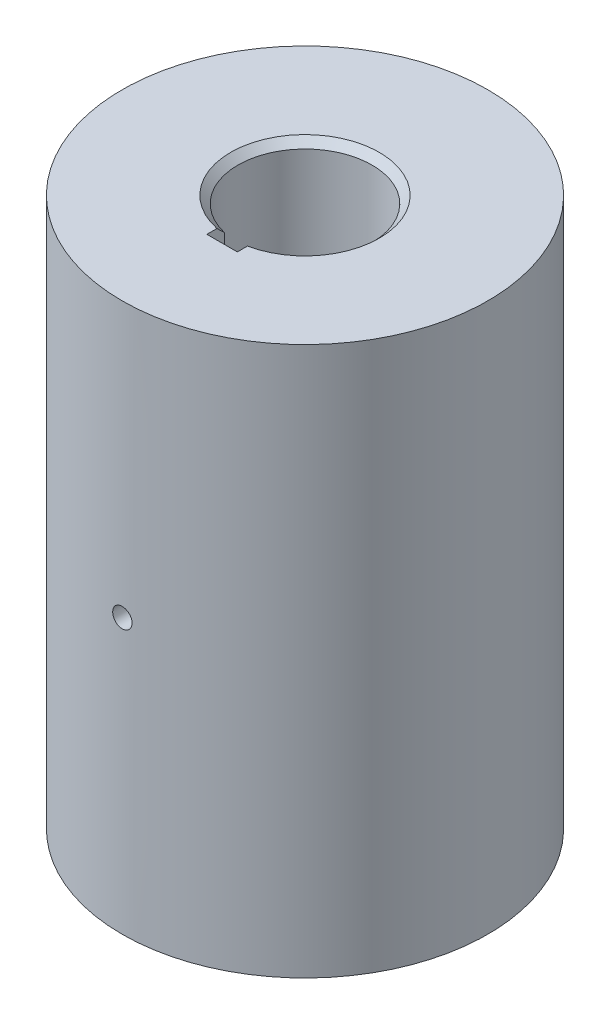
ISO-10303-21;
HEADER;
FILE_DESCRIPTION(('STEP AP214'),'2;1');
FILE_NAME('part.step','',(''),(''),'','','');
FILE_SCHEMA(('AUTOMOTIVE_DESIGN { 1 0 10303 214 1 1 1 1 }'));
ENDSEC;
DATA;
#1=APPLICATION_CONTEXT('core data for automotive mechanical design processes');
#2=APPLICATION_PROTOCOL_DEFINITION('international standard','automotive_design',2000,#1);
#3=PRODUCT_CONTEXT('',#1,'mechanical');
#4=PRODUCT('Part','Part','',(#3));
#5=PRODUCT_RELATED_PRODUCT_CATEGORY('part','',(#4));
#6=PRODUCT_DEFINITION_FORMATION('','',#4);
#7=PRODUCT_DEFINITION_CONTEXT('part definition',#1,'design');
#8=PRODUCT_DEFINITION('design','',#6,#7);
#9=PRODUCT_DEFINITION_SHAPE('','',#8);
#10=(LENGTH_UNIT() NAMED_UNIT(*) SI_UNIT(.MILLI.,.METRE.));
#11=(NAMED_UNIT(*) PLANE_ANGLE_UNIT() SI_UNIT($,.RADIAN.));
#12=(NAMED_UNIT(*) SI_UNIT($,.STERADIAN.) SOLID_ANGLE_UNIT());
#13=UNCERTAINTY_MEASURE_WITH_UNIT(LENGTH_MEASURE(1.E-05),#10,'distance_accuracy_value','');
#14=(GEOMETRIC_REPRESENTATION_CONTEXT(3) GLOBAL_UNCERTAINTY_ASSIGNED_CONTEXT((#13)) GLOBAL_UNIT_ASSIGNED_CONTEXT((#10,
#11,#12)) REPRESENTATION_CONTEXT('',''));
#15=CARTESIAN_POINT('',(0.,0.,0.));
#16=DIRECTION('',(0.,0.,1.));
#17=DIRECTION('',(1.,0.,0.));
#18=AXIS2_PLACEMENT_3D('',#15,#16,#17);
#19=CARTESIAN_POINT('',(0.,114.3,0.));
#20=DIRECTION('',(0.,-1.,0.));
#21=DIRECTION('',(0.,0.,-1.));
#22=AXIS2_PLACEMENT_3D('',#19,#20,#21);
#23=CYLINDRICAL_SURFACE('',#22,38.1);
#24=CARTESIAN_POINT('',(2.0193,57.15,38.0464509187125));
#25=CARTESIAN_POINT('',(2.01929500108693,57.0366605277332,38.046451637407));
#26=CARTESIAN_POINT('',(2.00972565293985,56.9232409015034,38.0469628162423));
#27=CARTESIAN_POINT('',(1.97168770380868,56.6995311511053,38.048952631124));
#28=CARTESIAN_POINT('',(1.94319689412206,56.5892448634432,38.0504324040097));
#29=CARTESIAN_POINT('',(1.86813462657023,56.3750747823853,38.0541913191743));
#30=CARTESIAN_POINT('',(1.82157245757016,56.2711877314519,38.0564700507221));
#31=CARTESIAN_POINT('',(1.71170363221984,56.0727319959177,38.0615695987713));
#32=CARTESIAN_POINT('',(1.64840090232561,55.9781611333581,38.0643902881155));
#33=CARTESIAN_POINT('',(1.50676927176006,55.8008884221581,38.0702595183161));
#34=CARTESIAN_POINT('',(1.4284256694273,55.718198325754,38.0733082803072));
#35=CARTESIAN_POINT('',(1.258965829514,55.5671347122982,38.0792880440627));
#36=CARTESIAN_POINT('',(1.16784906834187,55.498761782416,38.0822190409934));
#37=CARTESIAN_POINT('',(0.97536669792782,55.3782400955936,38.087634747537));
#38=CARTESIAN_POINT('',(0.873995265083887,55.3261006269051,38.0901192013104));
#39=CARTESIAN_POINT('',(0.663922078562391,55.2395854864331,38.094359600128));
#40=CARTESIAN_POINT('',(0.555220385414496,55.2052096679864,38.0961155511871));
#41=CARTESIAN_POINT('',(0.333681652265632,55.1552290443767,38.0986995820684));
#42=CARTESIAN_POINT('',(0.220848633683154,55.1396064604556,38.0995285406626));
#43=CARTESIAN_POINT('',(-0.00584114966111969,55.1275208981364,38.1001681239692));
#44=CARTESIAN_POINT('',(-0.119697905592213,55.131057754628,38.0999787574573));
#45=CARTESIAN_POINT('',(-0.345082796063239,55.1571759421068,38.0986037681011));
#46=CARTESIAN_POINT('',(-0.456613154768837,55.179738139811,38.0974191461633));
#47=CARTESIAN_POINT('',(-0.674301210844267,55.2432368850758,38.0941882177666));
#48=CARTESIAN_POINT('',(-0.78045888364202,55.2841735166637,38.0921419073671));
#49=CARTESIAN_POINT('',(-0.984449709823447,55.3832808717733,38.0874163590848));
#50=CARTESIAN_POINT('',(-1.08227862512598,55.4414603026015,38.0847368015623));
#51=CARTESIAN_POINT('',(-1.2667886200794,55.5733954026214,38.0790464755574));
#52=CARTESIAN_POINT('',(-1.35346961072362,55.6471511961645,38.0760357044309));
#53=CARTESIAN_POINT('',(-1.51333480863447,55.8082535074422,38.0700175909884));
#54=CARTESIAN_POINT('',(-1.58650228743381,55.8956166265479,38.067010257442));
#55=CARTESIAN_POINT('',(-1.71713461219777,56.0813953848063,38.0613417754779));
#56=CARTESIAN_POINT('',(-1.7745994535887,56.1798110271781,38.058680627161));
#57=CARTESIAN_POINT('',(-1.87219388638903,56.3849113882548,38.0540049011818));
#58=CARTESIAN_POINT('',(-1.91232283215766,56.4915964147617,38.0519903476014));
#59=CARTESIAN_POINT('',(-1.9740951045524,56.7102025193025,38.0488359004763));
#60=CARTESIAN_POINT('',(-1.99573858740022,56.8221235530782,38.0476959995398));
#61=CARTESIAN_POINT('',(-2.01990483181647,57.0478788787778,38.0464207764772));
#62=CARTESIAN_POINT('',(-2.02245081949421,57.1617106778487,38.0462842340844));
#63=CARTESIAN_POINT('',(-2.00841042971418,57.388184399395,38.0470279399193));
#64=CARTESIAN_POINT('',(-1.99182412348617,57.5008263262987,38.0479081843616));
#65=CARTESIAN_POINT('',(-1.94000924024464,57.7216574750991,38.0505851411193));
#66=CARTESIAN_POINT('',(-1.90479130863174,57.8298492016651,38.0523813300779));
#67=CARTESIAN_POINT('',(-1.81672365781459,58.0387859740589,38.0566872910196));
#68=CARTESIAN_POINT('',(-1.76387382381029,58.1395309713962,38.0591970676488));
#69=CARTESIAN_POINT('',(-1.64198302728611,58.3308213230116,38.0646503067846));
#70=CARTESIAN_POINT('',(-1.57292647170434,58.4213567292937,38.0675941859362));
#71=CARTESIAN_POINT('',(-1.4206052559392,58.5895578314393,38.0735823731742));
#72=CARTESIAN_POINT('',(-1.33734049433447,58.6672234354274,38.0766266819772));
#73=CARTESIAN_POINT('',(-1.15886664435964,58.8075584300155,38.0824761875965));
#74=CARTESIAN_POINT('',(-1.06364574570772,58.8702128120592,38.0852811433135));
#75=CARTESIAN_POINT('',(-0.864022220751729,58.9786442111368,38.0903323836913));
#76=CARTESIAN_POINT('',(-0.759619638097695,59.0244213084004,38.0925786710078));
#77=CARTESIAN_POINT('',(-0.544652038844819,59.0977724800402,38.096258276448));
#78=CARTESIAN_POINT('',(-0.434090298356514,59.125356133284,38.0976920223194));
#79=CARTESIAN_POINT('',(-0.209897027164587,59.1615687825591,38.0995866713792));
#80=CARTESIAN_POINT('',(-0.0962655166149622,59.1701979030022,38.1000475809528));
#81=CARTESIAN_POINT('',(0.130692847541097,59.1682553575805,38.0999446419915));
#82=CARTESIAN_POINT('',(0.244019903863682,59.1577072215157,38.0993820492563));
#83=CARTESIAN_POINT('',(0.467291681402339,59.1177582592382,38.0972979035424));
#84=CARTESIAN_POINT('',(0.577236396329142,59.0883573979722,38.0957763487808));
#85=CARTESIAN_POINT('',(0.79062713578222,59.0115425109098,38.0919454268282));
#86=CARTESIAN_POINT('',(0.894073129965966,58.9641284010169,38.0896360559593));
#87=CARTESIAN_POINT('',(1.09153828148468,58.8526367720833,38.0844891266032));
#88=CARTESIAN_POINT('',(1.18555771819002,58.7885597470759,38.0816515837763));
#89=CARTESIAN_POINT('',(1.36161896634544,58.6454761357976,38.0757636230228));
#90=CARTESIAN_POINT('',(1.4436472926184,58.5664529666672,38.0727129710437));
#91=CARTESIAN_POINT('',(1.59329977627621,58.3957345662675,38.0667442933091));
#92=CARTESIAN_POINT('',(1.66092038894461,58.3040362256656,38.0638263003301));
#93=CARTESIAN_POINT('',(1.77987367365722,58.1104911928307,38.0584499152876));
#94=CARTESIAN_POINT('',(1.83118964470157,58.0086342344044,38.0559919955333));
#95=CARTESIAN_POINT('',(1.91593013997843,57.7978130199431,38.0518203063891));
#96=CARTESIAN_POINT('',(1.94937575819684,57.6888573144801,38.0501056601));
#97=CARTESIAN_POINT('',(1.98867080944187,57.5076890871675,38.0480670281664));
#98=CARTESIAN_POINT('',(2.00014205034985,57.4366495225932,38.0474636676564));
#99=CARTESIAN_POINT('',(2.01545822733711,57.2937507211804,38.0466553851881));
#100=CARTESIAN_POINT('',(2.01930317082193,57.221891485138,38.0464504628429));
#101=CARTESIAN_POINT('',(2.0193,57.15,38.0464509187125));
#102=B_SPLINE_CURVE_WITH_KNOTS('',3,(#24,#25,#26,#27,#28,#29,#30,#31,#32,#33,#34,#35,#36,#37,
#38,#39,#40,#41,#42,#43,#44,#45,#46,#47,#48,#49,#50,#51,#52,#53,#54,#55,#56,#57,#58,#59,#60,#61,
#62,#63,#64,#65,#66,#67,#68,#69,#70,#71,#72,#73,#74,#75,#76,#77,#78,#79,#80,#81,#82,#83,#84,#85,
#86,#87,#88,#89,#90,#91,#92,#93,#94,#95,#96,#97,#98,#99,#100,#101),.UNSPECIFIED.,.T.,.F.,(4,2,2,
2,2,2,2,2,2,2,2,2,2,2,2,2,2,2,2,2,2,2,2,2,2,2,2,2,2,2,2,2,2,2,2,2,2,2,4),(0.,0.339755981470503,
0.679911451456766,1.01989230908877,1.35979349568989,1.70002862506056,2.04027770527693,
2.38072110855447,2.72116170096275,3.06127928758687,3.40139394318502,3.74116696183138,
4.08094153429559,4.42088798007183,4.76083713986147,5.10120434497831,5.44157164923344,
5.78195162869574,6.12232873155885,6.46229180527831,6.8022536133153,7.14202138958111,
7.48179137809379,7.82188962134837,8.16199029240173,8.50242959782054,8.84286728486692,
9.18312558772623,9.52338165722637,9.86322052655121,10.2030600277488,10.5429011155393,
10.8827321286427,11.2229424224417,11.5632363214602,11.9038776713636,12.2441160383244,
12.4596242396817,12.6751322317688),.UNSPECIFIED.);
#103=CARTESIAN_POINT('',(2.0193,57.15,38.0464509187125));
#104=VERTEX_POINT('',#103);
#105=EDGE_CURVE('E11',#104,#104,#102,.T.);
#106=ORIENTED_EDGE('',*,*,#105,.T.);
#107=EDGE_LOOP('',(#106));
#108=FACE_BOUND('',#107,.T.);
#109=CARTESIAN_POINT('',(0.,114.3,0.));
#110=DIRECTION('',(0.,1.,0.));
#111=DIRECTION('',(0.,0.,1.));
#112=AXIS2_PLACEMENT_3D('',#109,#110,#111);
#113=CIRCLE('',#112,38.1);
#114=CARTESIAN_POINT('',(0.,114.3,38.1));
#115=VERTEX_POINT('',#114);
#116=EDGE_CURVE('E162',#115,#115,#113,.T.);
#117=ORIENTED_EDGE('',*,*,#116,.F.);
#118=EDGE_LOOP('',(#117));
#119=FACE_BOUND('',#118,.T.);
#120=CARTESIAN_POINT('',(0.,0.,0.));
#121=DIRECTION('',(0.,1.,0.));
#122=DIRECTION('',(0.,0.,1.));
#123=AXIS2_PLACEMENT_3D('',#120,#121,#122);
#124=CIRCLE('',#123,38.1);
#125=CARTESIAN_POINT('',(0.,0.,38.1));
#126=VERTEX_POINT('',#125);
#127=EDGE_CURVE('E161',#126,#126,#124,.T.);
#128=ORIENTED_EDGE('',*,*,#127,.T.);
#129=EDGE_LOOP('',(#128));
#130=FACE_BOUND('',#129,.T.);
#131=ADVANCED_FACE('F36',(#108,#119,#130),#23,.T.);
#132=CARTESIAN_POINT('',(0.,114.3,0.));
#133=DIRECTION('',(0.,1.,0.));
#134=DIRECTION('',(0.,0.,1.));
#135=AXIS2_PLACEMENT_3D('',#132,#133,#134);
#136=PLANE('',#135);
#137=DIRECTION('',(0.,0.,1.));
#138=VECTOR('',#137,1.);
#139=CARTESIAN_POINT('',(-3.175,114.3,0.));
#140=LINE('',#139,#138);
#141=CARTESIAN_POINT('',(-3.175,114.3,15.1652039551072));
#142=VERTEX_POINT('',#141);
#143=CARTESIAN_POINT('',(-3.175,114.3,17.272));
#144=VERTEX_POINT('',#143);
#145=EDGE_CURVE('E102',#142,#144,#140,.T.);
#146=ORIENTED_EDGE('',*,*,#145,.F.);
#147=CARTESIAN_POINT('',(0.,114.3,0.));
#148=DIRECTION('',(0.,1.,0.));
#149=DIRECTION('',(0.,0.,1.));
#150=AXIS2_PLACEMENT_3D('',#147,#148,#149);
#151=CIRCLE('',#150,15.494);
#152=CARTESIAN_POINT('',(3.175,114.3,15.1652039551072));
#153=VERTEX_POINT('',#152);
#154=EDGE_CURVE('E170',#142,#153,#151,.F.);
#155=ORIENTED_EDGE('',*,*,#154,.T.);
#156=DIRECTION('',(0.,0.,-1.));
#157=VECTOR('',#156,1.);
#158=CARTESIAN_POINT('',(3.175,114.3,0.));
#159=LINE('',#158,#157);
#160=CARTESIAN_POINT('',(3.175,114.3,17.272));
#161=VERTEX_POINT('',#160);
#162=EDGE_CURVE('E55',#161,#153,#159,.T.);
#163=ORIENTED_EDGE('',*,*,#162,.F.);
#164=DIRECTION('',(1.,0.,0.));
#165=VECTOR('',#164,1.);
#166=CARTESIAN_POINT('',(-3.175,114.3,17.272));
#167=LINE('',#166,#165);
#168=EDGE_CURVE('E122',#144,#161,#167,.T.);
#169=ORIENTED_EDGE('',*,*,#168,.F.);
#170=EDGE_LOOP('',(#146,#155,#163,#169));
#171=FACE_BOUND('',#170,.T.);
#172=ORIENTED_EDGE('',*,*,#116,.T.);
#173=EDGE_LOOP('',(#172));
#174=FACE_BOUND('',#173,.T.);
#175=ADVANCED_FACE('F228',(#171,#174),#136,.T.);
#176=CARTESIAN_POINT('',(0.,0.,0.));
#177=DIRECTION('',(0.,1.,0.));
#178=DIRECTION('',(0.,0.,1.));
#179=AXIS2_PLACEMENT_3D('',#176,#177,#178);
#180=PLANE('',#179);
#181=CARTESIAN_POINT('',(0.,0.,0.));
#182=DIRECTION('',(0.,1.,0.));
#183=DIRECTION('',(0.,0.,1.));
#184=AXIS2_PLACEMENT_3D('',#181,#182,#183);
#185=CIRCLE('',#184,13.97);
#186=CARTESIAN_POINT('',(3.175,0.,13.6044211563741));
#187=VERTEX_POINT('',#186);
#188=CARTESIAN_POINT('',(-3.175,0.,13.6044211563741));
#189=VERTEX_POINT('',#188);
#190=EDGE_CURVE('E120',#187,#189,#185,.T.);
#191=ORIENTED_EDGE('',*,*,#190,.T.);
#192=DIRECTION('',(0.,0.,1.));
#193=VECTOR('',#192,1.);
#194=CARTESIAN_POINT('',(-3.175,0.,0.));
#195=LINE('',#194,#193);
#196=CARTESIAN_POINT('',(-3.175,0.,17.272));
#197=VERTEX_POINT('',#196);
#198=EDGE_CURVE('E99',#189,#197,#195,.T.);
#199=ORIENTED_EDGE('',*,*,#198,.T.);
#200=DIRECTION('',(1.,0.,0.));
#201=VECTOR('',#200,1.);
#202=CARTESIAN_POINT('',(-3.175,0.,17.272));
#203=LINE('',#202,#201);
#204=CARTESIAN_POINT('',(3.175,0.,17.272));
#205=VERTEX_POINT('',#204);
#206=EDGE_CURVE('E110',#197,#205,#203,.T.);
#207=ORIENTED_EDGE('',*,*,#206,.T.);
#208=DIRECTION('',(0.,0.,-1.));
#209=VECTOR('',#208,1.);
#210=CARTESIAN_POINT('',(3.175,0.,0.));
#211=LINE('',#210,#209);
#212=EDGE_CURVE('E107',#205,#187,#211,.T.);
#213=ORIENTED_EDGE('',*,*,#212,.T.);
#214=EDGE_LOOP('',(#191,#199,#207,#213));
#215=FACE_BOUND('',#214,.T.);
#216=CARTESIAN_POINT('',(0.,0.,25.4));
#217=DIRECTION('',(0.,-1.,0.));
#218=DIRECTION('',(0.,0.,-1.));
#219=AXIS2_PLACEMENT_3D('',#216,#217,#218);
#220=CIRCLE('',#219,3.96875);
#221=CARTESIAN_POINT('',(0.,0.,21.43125));
#222=VERTEX_POINT('',#221);
#223=EDGE_CURVE('E137',#222,#222,#220,.T.);
#224=ORIENTED_EDGE('',*,*,#223,.F.);
#225=EDGE_LOOP('',(#224));
#226=FACE_BOUND('',#225,.T.);
#227=CARTESIAN_POINT('',(25.4,0.,0.));
#228=DIRECTION('',(0.,-1.,0.));
#229=DIRECTION('',(0.,0.,-1.));
#230=AXIS2_PLACEMENT_3D('',#227,#228,#229);
#231=CIRCLE('',#230,3.96875);
#232=CARTESIAN_POINT('',(25.4,0.,-3.96874999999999));
#233=VERTEX_POINT('',#232);
#234=EDGE_CURVE('E143',#233,#233,#231,.T.);
#235=ORIENTED_EDGE('',*,*,#234,.F.);
#236=EDGE_LOOP('',(#235));
#237=FACE_BOUND('',#236,.T.);
#238=CARTESIAN_POINT('',(0.,0.,-25.4));
#239=DIRECTION('',(0.,-1.,0.));
#240=DIRECTION('',(0.,0.,-1.));
#241=AXIS2_PLACEMENT_3D('',#238,#239,#240);
#242=CIRCLE('',#241,3.96875);
#243=CARTESIAN_POINT('',(0.,0.,-29.36875));
#244=VERTEX_POINT('',#243);
#245=EDGE_CURVE('E149',#244,#244,#242,.T.);
#246=ORIENTED_EDGE('',*,*,#245,.F.);
#247=EDGE_LOOP('',(#246));
#248=FACE_BOUND('',#247,.T.);
#249=CARTESIAN_POINT('',(-25.4,0.,0.));
#250=DIRECTION('',(0.,-1.,0.));
#251=DIRECTION('',(0.,0.,-1.));
#252=AXIS2_PLACEMENT_3D('',#249,#250,#251);
#253=CIRCLE('',#252,3.96875);
#254=CARTESIAN_POINT('',(-25.4,0.,-3.96874999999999));
#255=VERTEX_POINT('',#254);
#256=EDGE_CURVE('E155',#255,#255,#253,.T.);
#257=ORIENTED_EDGE('',*,*,#256,.F.);
#258=EDGE_LOOP('',(#257));
#259=FACE_BOUND('',#258,.T.);
#260=ORIENTED_EDGE('',*,*,#127,.F.);
#261=EDGE_LOOP('',(#260));
#262=FACE_BOUND('',#261,.T.);
#263=ADVANCED_FACE('F117',(#215,#226,#237,#248,#259,#262),#180,.F.);
#264=CARTESIAN_POINT('',(-25.4,23.8252,0.));
#265=DIRECTION('',(0.,-1.,0.));
#266=DIRECTION('',(0.,0.,-1.));
#267=AXIS2_PLACEMENT_3D('',#264,#265,#266);
#268=CONICAL_SURFACE('',#267,3.96875,1.02974425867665);
#269=CARTESIAN_POINT('',(-25.4,26.2098655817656,0.));
#270=VERTEX_POINT('',#269);
#271=VERTEX_LOOP('',#270);
#272=FACE_BOUND('',#271,.T.);
#273=CARTESIAN_POINT('',(-25.4,23.8252,0.));
#274=DIRECTION('',(0.,-1.,0.));
#275=DIRECTION('',(0.,0.,-1.));
#276=AXIS2_PLACEMENT_3D('',#273,#274,#275);
#277=CIRCLE('',#276,3.96875);
#278=CARTESIAN_POINT('',(-25.4,23.8252,-3.96874999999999));
#279=VERTEX_POINT('',#278);
#280=EDGE_CURVE('E158',#279,#279,#277,.T.);
#281=ORIENTED_EDGE('',*,*,#280,.T.);
#282=EDGE_LOOP('',(#281));
#283=FACE_BOUND('',#282,.T.);
#284=ADVANCED_FACE('F224',(#272,#283),#268,.F.);
#285=CARTESIAN_POINT('',(-25.4,0.,0.));
#286=DIRECTION('',(0.,-1.,0.));
#287=DIRECTION('',(0.,0.,-1.));
#288=AXIS2_PLACEMENT_3D('',#285,#286,#287);
#289=CYLINDRICAL_SURFACE('',#288,3.96875);
#290=ORIENTED_EDGE('',*,*,#280,.F.);
#291=EDGE_LOOP('',(#290));
#292=FACE_BOUND('',#291,.T.);
#293=ORIENTED_EDGE('',*,*,#256,.T.);
#294=EDGE_LOOP('',(#293));
#295=FACE_BOUND('',#294,.T.);
#296=ADVANCED_FACE('F220',(#292,#295),#289,.F.);
#297=CARTESIAN_POINT('',(0.,23.8252,-25.4));
#298=DIRECTION('',(0.,-1.,0.));
#299=DIRECTION('',(0.,0.,-1.));
#300=AXIS2_PLACEMENT_3D('',#297,#298,#299);
#301=CONICAL_SURFACE('',#300,3.96875,1.02974425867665);
#302=CARTESIAN_POINT('',(0.,26.2098655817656,-25.4));
#303=VERTEX_POINT('',#302);
#304=VERTEX_LOOP('',#303);
#305=FACE_BOUND('',#304,.T.);
#306=CARTESIAN_POINT('',(0.,23.8252,-25.4));
#307=DIRECTION('',(0.,-1.,0.));
#308=DIRECTION('',(0.,0.,-1.));
#309=AXIS2_PLACEMENT_3D('',#306,#307,#308);
#310=CIRCLE('',#309,3.96875);
#311=CARTESIAN_POINT('',(0.,23.8252,-29.36875));
#312=VERTEX_POINT('',#311);
#313=EDGE_CURVE('E152',#312,#312,#310,.T.);
#314=ORIENTED_EDGE('',*,*,#313,.T.);
#315=EDGE_LOOP('',(#314));
#316=FACE_BOUND('',#315,.T.);
#317=ADVANCED_FACE('F216',(#305,#316),#301,.F.);
#318=CARTESIAN_POINT('',(0.,0.,-25.4));
#319=DIRECTION('',(0.,-1.,0.));
#320=DIRECTION('',(0.,0.,-1.));
#321=AXIS2_PLACEMENT_3D('',#318,#319,#320);
#322=CYLINDRICAL_SURFACE('',#321,3.96875);
#323=ORIENTED_EDGE('',*,*,#313,.F.);
#324=EDGE_LOOP('',(#323));
#325=FACE_BOUND('',#324,.T.);
#326=ORIENTED_EDGE('',*,*,#245,.T.);
#327=EDGE_LOOP('',(#326));
#328=FACE_BOUND('',#327,.T.);
#329=ADVANCED_FACE('F212',(#325,#328),#322,.F.);
#330=CARTESIAN_POINT('',(25.4,23.8252,0.));
#331=DIRECTION('',(0.,-1.,0.));
#332=DIRECTION('',(0.,0.,-1.));
#333=AXIS2_PLACEMENT_3D('',#330,#331,#332);
#334=CONICAL_SURFACE('',#333,3.96875,1.02974425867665);
#335=CARTESIAN_POINT('',(25.4,26.2098655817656,0.));
#336=VERTEX_POINT('',#335);
#337=VERTEX_LOOP('',#336);
#338=FACE_BOUND('',#337,.T.);
#339=CARTESIAN_POINT('',(25.4,23.8252,0.));
#340=DIRECTION('',(0.,-1.,0.));
#341=DIRECTION('',(0.,0.,-1.));
#342=AXIS2_PLACEMENT_3D('',#339,#340,#341);
#343=CIRCLE('',#342,3.96875);
#344=CARTESIAN_POINT('',(25.4,23.8252,-3.96874999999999));
#345=VERTEX_POINT('',#344);
#346=EDGE_CURVE('E146',#345,#345,#343,.T.);
#347=ORIENTED_EDGE('',*,*,#346,.T.);
#348=EDGE_LOOP('',(#347));
#349=FACE_BOUND('',#348,.T.);
#350=ADVANCED_FACE('F208',(#338,#349),#334,.F.);
#351=CARTESIAN_POINT('',(25.4,0.,0.));
#352=DIRECTION('',(0.,-1.,0.));
#353=DIRECTION('',(0.,0.,-1.));
#354=AXIS2_PLACEMENT_3D('',#351,#352,#353);
#355=CYLINDRICAL_SURFACE('',#354,3.96875);
#356=ORIENTED_EDGE('',*,*,#346,.F.);
#357=EDGE_LOOP('',(#356));
#358=FACE_BOUND('',#357,.T.);
#359=ORIENTED_EDGE('',*,*,#234,.T.);
#360=EDGE_LOOP('',(#359));
#361=FACE_BOUND('',#360,.T.);
#362=ADVANCED_FACE('F204',(#358,#361),#355,.F.);
#363=CARTESIAN_POINT('',(0.,23.8252,25.4));
#364=DIRECTION('',(0.,-1.,0.));
#365=DIRECTION('',(0.,0.,-1.));
#366=AXIS2_PLACEMENT_3D('',#363,#364,#365);
#367=CONICAL_SURFACE('',#366,3.96875,1.02974425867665);
#368=CARTESIAN_POINT('',(0.,26.2098655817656,25.4));
#369=VERTEX_POINT('',#368);
#370=VERTEX_LOOP('',#369);
#371=FACE_BOUND('',#370,.T.);
#372=CARTESIAN_POINT('',(0.,23.8252,25.4));
#373=DIRECTION('',(0.,-1.,0.));
#374=DIRECTION('',(0.,0.,-1.));
#375=AXIS2_PLACEMENT_3D('',#372,#373,#374);
#376=CIRCLE('',#375,3.96875);
#377=CARTESIAN_POINT('',(0.,23.8252,21.43125));
#378=VERTEX_POINT('',#377);
#379=EDGE_CURVE('E140',#378,#378,#376,.T.);
#380=ORIENTED_EDGE('',*,*,#379,.T.);
#381=EDGE_LOOP('',(#380));
#382=FACE_BOUND('',#381,.T.);
#383=ADVANCED_FACE('F200',(#371,#382),#367,.F.);
#384=CARTESIAN_POINT('',(0.,0.,25.4));
#385=DIRECTION('',(0.,-1.,0.));
#386=DIRECTION('',(0.,0.,-1.));
#387=AXIS2_PLACEMENT_3D('',#384,#385,#386);
#388=CYLINDRICAL_SURFACE('',#387,3.96875);
#389=ORIENTED_EDGE('',*,*,#379,.F.);
#390=EDGE_LOOP('',(#389));
#391=FACE_BOUND('',#390,.T.);
#392=ORIENTED_EDGE('',*,*,#223,.T.);
#393=EDGE_LOOP('',(#392));
#394=FACE_BOUND('',#393,.T.);
#395=ADVANCED_FACE('F196',(#391,#394),#388,.F.);
#396=CARTESIAN_POINT('',(0.,0.,0.));
#397=DIRECTION('',(0.,1.,0.));
#398=DIRECTION('',(0.,0.,1.));
#399=AXIS2_PLACEMENT_3D('',#396,#397,#398);
#400=CYLINDRICAL_SURFACE('',#399,13.97);
#401=CARTESIAN_POINT('',(0.,112.776,0.));
#402=DIRECTION('',(0.,1.,0.));
#403=DIRECTION('',(0.,0.,1.));
#404=AXIS2_PLACEMENT_3D('',#401,#402,#403);
#405=CIRCLE('',#404,13.97);
#406=CARTESIAN_POINT('',(3.175,112.776,13.6044211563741));
#407=VERTEX_POINT('',#406);
#408=CARTESIAN_POINT('',(-3.175,112.776,13.6044211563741));
#409=VERTEX_POINT('',#408);
#410=EDGE_CURVE('E165',#407,#409,#405,.T.);
#411=ORIENTED_EDGE('',*,*,#410,.T.);
#412=DIRECTION('',(0.,1.,0.));
#413=VECTOR('',#412,1.);
#414=CARTESIAN_POINT('',(-3.175,0.,13.6044211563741));
#415=LINE('',#414,#413);
#416=EDGE_CURVE('E134',#409,#189,#415,.F.);
#417=ORIENTED_EDGE('',*,*,#416,.T.);
#418=ORIENTED_EDGE('',*,*,#190,.F.);
#419=DIRECTION('',(0.,1.,0.));
#420=VECTOR('',#419,1.);
#421=CARTESIAN_POINT('',(3.175,0.,13.6044211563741));
#422=LINE('',#421,#420);
#423=EDGE_CURVE('E130',#187,#407,#422,.T.);
#424=ORIENTED_EDGE('',*,*,#423,.T.);
#425=EDGE_LOOP('',(#411,#417,#418,#424));
#426=FACE_BOUND('',#425,.T.);
#427=ADVANCED_FACE('F193',(#426),#400,.F.);
#428=CARTESIAN_POINT('',(0.,112.776,0.));
#429=DIRECTION('',(0.,1.,0.));
#430=DIRECTION('',(0.,0.,1.));
#431=AXIS2_PLACEMENT_3D('',#428,#429,#430);
#432=CONICAL_SURFACE('',#431,13.97,0.785398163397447);
#433=CARTESIAN_POINT('',(-3.175,104.167762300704,4.32063305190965));
#434=CARTESIAN_POINT('',(-3.175,104.250052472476,4.42274161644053));
#435=CARTESIAN_POINT('',(-3.175,104.332949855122,4.52435723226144));
#436=CARTESIAN_POINT('',(-3.175,104.499789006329,4.72672273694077));
#437=CARTESIAN_POINT('',(-3.175,104.583730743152,4.82747265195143));
#438=CARTESIAN_POINT('',(-3.175,104.83685510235,5.12858966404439));
#439=CARTESIAN_POINT('',(-3.175,105.007356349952,5.32784803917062));
#440=CARTESIAN_POINT('',(-3.175,105.350900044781,5.72405460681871));
#441=CARTESIAN_POINT('',(-3.175,105.523941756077,5.92100343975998));
#442=CARTESIAN_POINT('',(-3.175,105.872003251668,6.31315529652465));
#443=CARTESIAN_POINT('',(-3.175,106.047023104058,6.50835825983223));
#444=CARTESIAN_POINT('',(-3.175,106.398517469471,6.89729077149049));
#445=CARTESIAN_POINT('',(-3.175,106.574991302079,7.09102093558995));
#446=CARTESIAN_POINT('',(-3.175,106.929154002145,7.47736203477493));
#447=CARTESIAN_POINT('',(-3.175,107.106842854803,7.66997298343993));
#448=CARTESIAN_POINT('',(-3.175,107.641399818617,8.2464843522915));
#449=CARTESIAN_POINT('',(-3.175,107.999728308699,8.62903024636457));
#450=CARTESIAN_POINT('',(-3.175,108.752174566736,9.42681372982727));
#451=CARTESIAN_POINT('',(-3.175,109.146545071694,9.84181235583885));
#452=CARTESIAN_POINT('',(-3.175,109.937434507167,10.6697309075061));
#453=CARTESIAN_POINT('',(-3.175,110.333953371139,11.0826508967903));
#454=CARTESIAN_POINT('',(-3.175,111.128641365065,11.9070939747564));
#455=CARTESIAN_POINT('',(-3.175,111.52681087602,12.318616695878));
#456=CARTESIAN_POINT('',(-3.175,112.324308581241,13.1405445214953));
#457=CARTESIAN_POINT('',(-3.175,112.723636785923,13.5509496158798));
#458=CARTESIAN_POINT('',(-3.175,113.61151220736,14.4614976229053));
#459=CARTESIAN_POINT('',(-3.175,114.100275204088,14.9614300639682));
#460=CARTESIAN_POINT('',(-3.175,115.07877324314,15.9603429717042));
#461=CARTESIAN_POINT('',(-3.175,115.568508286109,16.4593234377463));
#462=CARTESIAN_POINT('',(-3.175,117.038809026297,17.95518614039));
#463=CARTESIAN_POINT('',(-3.175,118.020471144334,18.9509905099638));
#464=CARTESIAN_POINT('',(-3.175,119.984936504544,20.9401724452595));
#465=CARTESIAN_POINT('',(-3.175,120.967738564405,21.9335511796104));
#466=CARTESIAN_POINT('',(-3.175,122.442838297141,23.4227259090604));
#467=CARTESIAN_POINT('',(-3.175,122.934686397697,23.918967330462));
#468=CARTESIAN_POINT('',(-3.175,123.918634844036,24.9111997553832));
#469=CARTESIAN_POINT('',(-3.175,124.410735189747,25.4071907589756));
#470=CARTESIAN_POINT('',(-3.175,124.902938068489,25.9030799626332));
#471=B_SPLINE_CURVE_WITH_KNOTS('',3,(#433,#434,#435,#436,#437,#438,#439,#440,#441,#442,#443,
#444,#445,#446,#447,#448,#449,#450,#451,#452,#453,#454,#455,#456,#457,#458,#459,#460,#461,#462,
#463,#464,#465,#466,#467,#468,#469,#470),.UNSPECIFIED.,.F.,.F.,(4,2,2,2,2,2,2,2,2,2,2,2,2,2,2,2,
2,2,4),(0.,0.39341492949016,0.786817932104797,1.57353120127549,2.36002090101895,
3.14653775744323,3.93270537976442,4.71886344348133,6.29131352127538,8.00879234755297,
9.7262182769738,11.4440655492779,13.1619283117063,15.2594000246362,17.3568731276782,
21.5518158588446,25.7439872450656,27.840062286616,29.9361367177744),.UNSPECIFIED.);
#472=EDGE_CURVE('E48',#409,#142,#471,.T.);
#473=ORIENTED_EDGE('',*,*,#472,.F.);
#474=ORIENTED_EDGE('',*,*,#410,.F.);
#475=CARTESIAN_POINT('',(3.175,124.902938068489,25.9030799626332));
#476=CARTESIAN_POINT('',(3.175,124.410494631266,25.4069483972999));
#477=CARTESIAN_POINT('',(3.175,123.918153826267,24.9107149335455));
#478=CARTESIAN_POINT('',(3.175,122.933724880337,23.9179974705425));
#479=CARTESIAN_POINT('',(3.175,122.441636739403,23.4215134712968));
#480=CARTESIAN_POINT('',(3.175,120.965871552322,21.9316651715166));
#481=CARTESIAN_POINT('',(3.175,119.982644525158,20.9378550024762));
#482=CARTESIAN_POINT('',(3.175,118.018234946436,18.9487227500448));
#483=CARTESIAN_POINT('',(3.175,117.037051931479,17.9534011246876));
#484=CARTESIAN_POINT('',(3.175,115.567443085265,16.458238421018));
#485=CARTESIAN_POINT('',(3.175,115.077921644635,15.9594744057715));
#486=CARTESIAN_POINT('',(3.175,114.099850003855,14.9609951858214));
#487=CARTESIAN_POINT('',(3.175,113.611299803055,14.4612799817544));
#488=CARTESIAN_POINT('',(3.175,112.74063091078,13.5683775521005));
#489=CARTESIAN_POINT('',(3.175,112.358260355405,13.1754359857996));
#490=CARTESIAN_POINT('',(3.175,111.594569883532,12.3885394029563));
#491=CARTESIAN_POINT('',(3.175,111.213249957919,11.9945843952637));
#492=CARTESIAN_POINT('',(3.175,110.452045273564,11.2053835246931));
#493=CARTESIAN_POINT('',(3.175,110.072160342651,10.8101378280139));
#494=CARTESIAN_POINT('',(3.175,109.314278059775,10.0178161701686));
#495=CARTESIAN_POINT('',(3.175,108.936280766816,9.62074015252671));
#496=CARTESIAN_POINT('',(3.175,108.18281141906,8.82388360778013));
#497=CARTESIAN_POINT('',(3.175,107.807340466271,8.42410203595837));
#498=CARTESIAN_POINT('',(3.175,107.247167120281,7.82164117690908));
#499=CARTESIAN_POINT('',(3.175,107.060956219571,7.62036495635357));
#500=CARTESIAN_POINT('',(3.175,106.689797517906,7.21664526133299));
#501=CARTESIAN_POINT('',(3.175,106.504849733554,7.01420177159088));
#502=CARTESIAN_POINT('',(3.175,106.136475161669,6.60776970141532));
#503=CARTESIAN_POINT('',(3.175,105.953049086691,6.403780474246));
#504=CARTESIAN_POINT('',(3.175,105.588284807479,5.99395491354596));
#505=CARTESIAN_POINT('',(3.175,105.406946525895,5.78811864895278));
#506=CARTESIAN_POINT('',(3.175,105.046974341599,5.37397934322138));
#507=CARTESIAN_POINT('',(3.175,104.868341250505,5.16567559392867));
#508=CARTESIAN_POINT('',(3.175,104.603223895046,4.85081161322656));
#509=CARTESIAN_POINT('',(3.175,104.515318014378,4.74544881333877));
#510=CARTESIAN_POINT('',(3.175,104.340640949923,4.53378139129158));
#511=CARTESIAN_POINT('',(3.175,104.253869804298,4.42747673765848));
#512=CARTESIAN_POINT('',(3.175,104.167762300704,4.32063305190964));
#513=B_SPLINE_CURVE_WITH_KNOTS('',3,(#475,#476,#477,#478,#479,#480,#481,#482,#483,#484,#485,
#486,#487,#488,#489,#490,#491,#492,#493,#494,#495,#496,#497,#498,#499,#500,#501,#502,#503,#504,
#505,#506,#507,#508,#509,#510,#511,#512),.UNSPECIFIED.,.F.,.F.,(4,2,2,2,2,2,2,2,2,2,2,2,2,2,2,2,
2,2,4),(0.,2.09709886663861,4.19419770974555,8.38818584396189,12.5810881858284,14.6776489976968,
16.774208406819,18.4190451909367,20.0638676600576,21.7084860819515,23.3531555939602,
24.9985012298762,25.8211024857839,26.6437145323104,27.4666921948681,28.2896392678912,
29.1128285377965,29.5244752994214,29.9361358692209),.UNSPECIFIED.);
#514=EDGE_CURVE('E173',#153,#407,#513,.T.);
#515=ORIENTED_EDGE('',*,*,#514,.F.);
#516=ORIENTED_EDGE('',*,*,#154,.F.);
#517=EDGE_LOOP('',(#473,#474,#515,#516));
#518=FACE_BOUND('',#517,.T.);
#519=ADVANCED_FACE('F38',(#518),#432,.F.);
#520=CARTESIAN_POINT('',(-3.175,0.,0.));
#521=DIRECTION('',(-1.,0.,0.));
#522=DIRECTION('',(0.,0.,1.));
#523=AXIS2_PLACEMENT_3D('',#520,#521,#522);
#524=PLANE('',#523);
#525=ORIENTED_EDGE('',*,*,#472,.T.);
#526=ORIENTED_EDGE('',*,*,#145,.T.);
#527=DIRECTION('',(0.,1.,0.));
#528=VECTOR('',#527,1.);
#529=CARTESIAN_POINT('',(-3.175,0.,17.272));
#530=LINE('',#529,#528);
#531=EDGE_CURVE('E95',#197,#144,#530,.T.);
#532=ORIENTED_EDGE('',*,*,#531,.F.);
#533=ORIENTED_EDGE('',*,*,#198,.F.);
#534=ORIENTED_EDGE('',*,*,#416,.F.);
#535=EDGE_LOOP('',(#525,#526,#532,#533,#534));
#536=FACE_BOUND('',#535,.T.);
#537=ADVANCED_FACE('F97',(#536),#524,.F.);
#538=CARTESIAN_POINT('',(3.175,0.,0.));
#539=DIRECTION('',(1.,0.,0.));
#540=DIRECTION('',(0.,0.,-1.));
#541=AXIS2_PLACEMENT_3D('',#538,#539,#540);
#542=PLANE('',#541);
#543=ORIENTED_EDGE('',*,*,#212,.F.);
#544=DIRECTION('',(0.,1.,0.));
#545=VECTOR('',#544,1.);
#546=CARTESIAN_POINT('',(3.175,0.,17.272));
#547=LINE('',#546,#545);
#548=EDGE_CURVE('E106',#205,#161,#547,.T.);
#549=ORIENTED_EDGE('',*,*,#548,.T.);
#550=ORIENTED_EDGE('',*,*,#162,.T.);
#551=ORIENTED_EDGE('',*,*,#514,.T.);
#552=ORIENTED_EDGE('',*,*,#423,.F.);
#553=EDGE_LOOP('',(#543,#549,#550,#551,#552));
#554=FACE_BOUND('',#553,.T.);
#555=ADVANCED_FACE('F182',(#554),#542,.F.);
#556=CARTESIAN_POINT('',(-3.175,0.,17.272));
#557=DIRECTION('',(0.,0.,1.));
#558=DIRECTION('',(1.,0.,0.));
#559=AXIS2_PLACEMENT_3D('',#556,#557,#558);
#560=PLANE('',#559);
#561=CARTESIAN_POINT('',(0.,57.15,17.272));
#562=DIRECTION('',(0.,0.,1.));
#563=DIRECTION('',(1.,0.,0.));
#564=AXIS2_PLACEMENT_3D('',#561,#562,#563);
#565=CIRCLE('',#564,2.0193);
#566=CARTESIAN_POINT('',(2.0193,57.15,17.272));
#567=VERTEX_POINT('',#566);
#568=EDGE_CURVE('E125',#567,#567,#565,.T.);
#569=ORIENTED_EDGE('',*,*,#568,.T.);
#570=EDGE_LOOP('',(#569));
#571=FACE_BOUND('',#570,.T.);
#572=ORIENTED_EDGE('',*,*,#168,.T.);
#573=ORIENTED_EDGE('',*,*,#548,.F.);
#574=ORIENTED_EDGE('',*,*,#206,.F.);
#575=ORIENTED_EDGE('',*,*,#531,.T.);
#576=EDGE_LOOP('',(#572,#573,#574,#575));
#577=FACE_BOUND('',#576,.T.);
#578=ADVANCED_FACE('F111',(#571,#577),#560,.F.);
#579=CARTESIAN_POINT('',(0.,57.15,38.1));
#580=DIRECTION('',(0.,0.,1.));
#581=DIRECTION('',(1.,0.,0.));
#582=AXIS2_PLACEMENT_3D('',#579,#580,#581);
#583=CYLINDRICAL_SURFACE('',#582,2.0193);
#584=ORIENTED_EDGE('',*,*,#105,.F.);
#585=EDGE_LOOP('',(#584));
#586=FACE_BOUND('',#585,.T.);
#587=ORIENTED_EDGE('',*,*,#568,.F.);
#588=EDGE_LOOP('',(#587));
#589=FACE_BOUND('',#588,.T.);
#590=ADVANCED_FACE('F186',(#586,#589),#583,.F.);
#591=CLOSED_SHELL('',(#131,#175,#263,#284,#296,#317,#329,#350,#362,#383,#395,#427,#519,#537,
#555,#578,#590));
#592=MANIFOLD_SOLID_BREP('B2',#591);
#593=ADVANCED_BREP_SHAPE_REPRESENTATION('',(#18,#592),#14);
#594=SHAPE_DEFINITION_REPRESENTATION(#9,#593);
ENDSEC;
END-ISO-10303-21;
